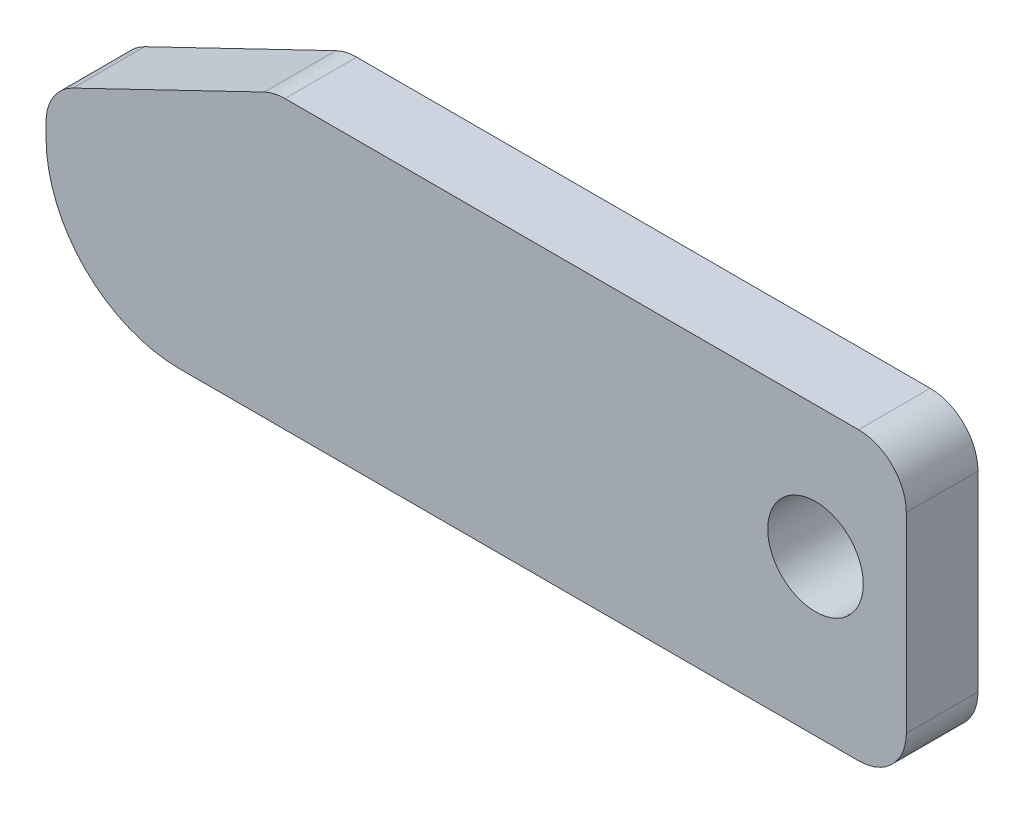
ISO-10303-21;
HEADER;
FILE_DESCRIPTION(('STEP AP214'),'2;1');
FILE_NAME('part.step','',(''),(''),'','','');
FILE_SCHEMA(('AUTOMOTIVE_DESIGN { 1 0 10303 214 1 1 1 1 }'));
ENDSEC;
DATA;
#1=APPLICATION_CONTEXT('core data for automotive mechanical design processes');
#2=APPLICATION_PROTOCOL_DEFINITION('international standard','automotive_design',2000,#1);
#3=PRODUCT_CONTEXT('',#1,'mechanical');
#4=PRODUCT('Part','Part','',(#3));
#5=PRODUCT_RELATED_PRODUCT_CATEGORY('part','',(#4));
#6=PRODUCT_DEFINITION_FORMATION('','',#4);
#7=PRODUCT_DEFINITION_CONTEXT('part definition',#1,'design');
#8=PRODUCT_DEFINITION('design','',#6,#7);
#9=PRODUCT_DEFINITION_SHAPE('','',#8);
#10=(LENGTH_UNIT() NAMED_UNIT(*) SI_UNIT(.MILLI.,.METRE.));
#11=(NAMED_UNIT(*) PLANE_ANGLE_UNIT() SI_UNIT($,.RADIAN.));
#12=(NAMED_UNIT(*) SI_UNIT($,.STERADIAN.) SOLID_ANGLE_UNIT());
#13=UNCERTAINTY_MEASURE_WITH_UNIT(LENGTH_MEASURE(1.E-05),#10,'distance_accuracy_value','');
#14=(GEOMETRIC_REPRESENTATION_CONTEXT(3) GLOBAL_UNCERTAINTY_ASSIGNED_CONTEXT((#13)) GLOBAL_UNIT_ASSIGNED_CONTEXT((#10,
#11,#12)) REPRESENTATION_CONTEXT('',''));
#15=CARTESIAN_POINT('',(0.,0.,0.));
#16=DIRECTION('',(0.,0.,1.));
#17=DIRECTION('',(1.,0.,0.));
#18=AXIS2_PLACEMENT_3D('',#15,#16,#17);
#19=CARTESIAN_POINT('',(-152.,28.,15.));
#20=DIRECTION('',(0.,0.,-1.));
#21=DIRECTION('',(-1.,0.,0.));
#22=AXIS2_PLACEMENT_3D('',#19,#20,#21);
#23=PLANE('',#22);
#24=CARTESIAN_POINT('',(-152.,28.,15.));
#25=DIRECTION('',(0.,0.,1.));
#26=DIRECTION('',(-1.,0.,0.));
#27=AXIS2_PLACEMENT_3D('',#24,#25,#26);
#28=CIRCLE('',#27,28.);
#29=CARTESIAN_POINT('',(-180.,28.,15.));
#30=VERTEX_POINT('',#29);
#31=CARTESIAN_POINT('',(-152.,0.,15.));
#32=VERTEX_POINT('',#31);
#33=EDGE_CURVE('E149',#30,#32,#28,.T.);
#34=ORIENTED_EDGE('',*,*,#33,.T.);
#35=DIRECTION('',(1.,0.,0.));
#36=VECTOR('',#35,1.);
#37=CARTESIAN_POINT('',(-152.,0.,15.));
#38=LINE('',#37,#36);
#39=CARTESIAN_POINT('',(-10.0000000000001,0.,15.));
#40=VERTEX_POINT('',#39);
#41=EDGE_CURVE('E122',#32,#40,#38,.T.);
#42=ORIENTED_EDGE('',*,*,#41,.T.);
#43=CARTESIAN_POINT('',(-10.,10.,15.));
#44=DIRECTION('',(0.,0.,1.));
#45=DIRECTION('',(1.,0.,0.));
#46=AXIS2_PLACEMENT_3D('',#43,#44,#45);
#47=CIRCLE('',#46,10.);
#48=CARTESIAN_POINT('',(0.,10.0000000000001,15.));
#49=VERTEX_POINT('',#48);
#50=EDGE_CURVE('E152',#40,#49,#47,.T.);
#51=ORIENTED_EDGE('',*,*,#50,.T.);
#52=DIRECTION('',(0.,1.,0.));
#53=VECTOR('',#52,1.);
#54=CARTESIAN_POINT('',(0.,49.9999999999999,15.));
#55=LINE('',#54,#53);
#56=CARTESIAN_POINT('',(0.,49.9999999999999,15.));
#57=VERTEX_POINT('',#56);
#58=EDGE_CURVE('E154',#49,#57,#55,.T.);
#59=ORIENTED_EDGE('',*,*,#58,.T.);
#60=CARTESIAN_POINT('',(-10.,50.,15.));
#61=DIRECTION('',(0.,0.,1.));
#62=DIRECTION('',(1.,0.,0.));
#63=AXIS2_PLACEMENT_3D('',#60,#61,#62);
#64=CIRCLE('',#63,10.);
#65=CARTESIAN_POINT('',(-10.0000000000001,60.,15.));
#66=VERTEX_POINT('',#65);
#67=EDGE_CURVE('E156',#57,#66,#64,.T.);
#68=ORIENTED_EDGE('',*,*,#67,.T.);
#69=DIRECTION('',(-1.,0.,0.));
#70=VECTOR('',#69,1.);
#71=CARTESIAN_POINT('',(-130.,60.,15.));
#72=LINE('',#71,#70);
#73=CARTESIAN_POINT('',(-130.,60.,15.));
#74=VERTEX_POINT('',#73);
#75=EDGE_CURVE('E158',#66,#74,#72,.T.);
#76=ORIENTED_EDGE('',*,*,#75,.T.);
#77=CARTESIAN_POINT('',(-130.,50.,15.));
#78=DIRECTION('',(0.,0.,1.));
#79=DIRECTION('',(1.,0.,0.));
#80=AXIS2_PLACEMENT_3D('',#77,#78,#79);
#81=CIRCLE('',#80,10.);
#82=CARTESIAN_POINT('',(-134.342109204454,59.0081123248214,15.));
#83=VERTEX_POINT('',#82);
#84=EDGE_CURVE('E160',#74,#83,#81,.T.);
#85=ORIENTED_EDGE('',*,*,#84,.T.);
#86=DIRECTION('',(-0.900811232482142,-0.434210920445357,0.));
#87=VECTOR('',#86,1.);
#88=CARTESIAN_POINT('',(-134.342109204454,59.0081123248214,15.));
#89=LINE('',#88,#87);
#90=CARTESIAN_POINT('',(-174.342109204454,39.727228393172,15.));
#91=VERTEX_POINT('',#90);
#92=EDGE_CURVE('E162',#83,#91,#89,.T.);
#93=ORIENTED_EDGE('',*,*,#92,.T.);
#94=CARTESIAN_POINT('',(-170.,30.7191160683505,15.));
#95=DIRECTION('',(0.,0.,1.));
#96=DIRECTION('',(1.,0.,0.));
#97=AXIS2_PLACEMENT_3D('',#94,#95,#96);
#98=CIRCLE('',#97,10.);
#99=CARTESIAN_POINT('',(-180.,30.7191160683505,15.));
#100=VERTEX_POINT('',#99);
#101=EDGE_CURVE('E51',#91,#100,#98,.T.);
#102=ORIENTED_EDGE('',*,*,#101,.T.);
#103=DIRECTION('',(0.,-1.,0.));
#104=VECTOR('',#103,1.);
#105=CARTESIAN_POINT('',(-180.,30.7191160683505,15.));
#106=LINE('',#105,#104);
#107=EDGE_CURVE('E46',#100,#30,#106,.T.);
#108=ORIENTED_EDGE('',*,*,#107,.T.);
#109=EDGE_LOOP('',(#34,#42,#51,#59,#68,#76,#85,#93,#102,#108));
#110=FACE_BOUND('',#109,.T.);
#111=CARTESIAN_POINT('',(-19.,32.5,15.));
#112=DIRECTION('',(0.,0.,1.));
#113=DIRECTION('',(1.,0.,0.));
#114=AXIS2_PLACEMENT_3D('',#111,#112,#113);
#115=CIRCLE('',#114,10.);
#116=CARTESIAN_POINT('',(-8.99999999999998,32.5,15.));
#117=VERTEX_POINT('',#116);
#118=EDGE_CURVE('E127',#117,#117,#115,.T.);
#119=ORIENTED_EDGE('',*,*,#118,.F.);
#120=EDGE_LOOP('',(#119));
#121=FACE_BOUND('',#120,.T.);
#122=ADVANCED_FACE('F31',(#110,#121),#23,.F.);
#123=CARTESIAN_POINT('',(-152.,28.,0.));
#124=DIRECTION('',(0.,0.,-1.));
#125=DIRECTION('',(-1.,0.,0.));
#126=AXIS2_PLACEMENT_3D('',#123,#124,#125);
#127=PLANE('',#126);
#128=CARTESIAN_POINT('',(-152.,28.,0.));
#129=DIRECTION('',(0.,0.,1.));
#130=DIRECTION('',(-1.,0.,0.));
#131=AXIS2_PLACEMENT_3D('',#128,#129,#130);
#132=CIRCLE('',#131,28.);
#133=CARTESIAN_POINT('',(-180.,28.,0.));
#134=VERTEX_POINT('',#133);
#135=CARTESIAN_POINT('',(-152.,0.,0.));
#136=VERTEX_POINT('',#135);
#137=EDGE_CURVE('E113',#134,#136,#132,.T.);
#138=ORIENTED_EDGE('',*,*,#137,.F.);
#139=DIRECTION('',(0.,-1.,0.));
#140=VECTOR('',#139,1.);
#141=CARTESIAN_POINT('',(-180.,30.7191160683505,0.));
#142=LINE('',#141,#140);
#143=CARTESIAN_POINT('',(-180.,30.7191160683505,0.));
#144=VERTEX_POINT('',#143);
#145=EDGE_CURVE('E147',#144,#134,#142,.T.);
#146=ORIENTED_EDGE('',*,*,#145,.F.);
#147=CARTESIAN_POINT('',(-170.,30.7191160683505,0.));
#148=DIRECTION('',(0.,0.,1.));
#149=DIRECTION('',(1.,0.,0.));
#150=AXIS2_PLACEMENT_3D('',#147,#148,#149);
#151=CIRCLE('',#150,10.);
#152=CARTESIAN_POINT('',(-174.342109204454,39.727228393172,0.));
#153=VERTEX_POINT('',#152);
#154=EDGE_CURVE('E145',#153,#144,#151,.T.);
#155=ORIENTED_EDGE('',*,*,#154,.F.);
#156=DIRECTION('',(-0.900811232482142,-0.434210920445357,0.));
#157=VECTOR('',#156,1.);
#158=CARTESIAN_POINT('',(-134.342109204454,59.0081123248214,0.));
#159=LINE('',#158,#157);
#160=CARTESIAN_POINT('',(-134.342109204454,59.0081123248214,0.));
#161=VERTEX_POINT('',#160);
#162=EDGE_CURVE('E143',#161,#153,#159,.T.);
#163=ORIENTED_EDGE('',*,*,#162,.F.);
#164=CARTESIAN_POINT('',(-130.,50.,0.));
#165=DIRECTION('',(0.,0.,1.));
#166=DIRECTION('',(1.,0.,0.));
#167=AXIS2_PLACEMENT_3D('',#164,#165,#166);
#168=CIRCLE('',#167,10.);
#169=CARTESIAN_POINT('',(-130.,60.,0.));
#170=VERTEX_POINT('',#169);
#171=EDGE_CURVE('E141',#170,#161,#168,.T.);
#172=ORIENTED_EDGE('',*,*,#171,.F.);
#173=DIRECTION('',(-1.,0.,0.));
#174=VECTOR('',#173,1.);
#175=CARTESIAN_POINT('',(-130.,60.,0.));
#176=LINE('',#175,#174);
#177=CARTESIAN_POINT('',(-10.0000000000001,60.,0.));
#178=VERTEX_POINT('',#177);
#179=EDGE_CURVE('E139',#178,#170,#176,.T.);
#180=ORIENTED_EDGE('',*,*,#179,.F.);
#181=CARTESIAN_POINT('',(-10.,50.,0.));
#182=DIRECTION('',(0.,0.,1.));
#183=DIRECTION('',(1.,0.,0.));
#184=AXIS2_PLACEMENT_3D('',#181,#182,#183);
#185=CIRCLE('',#184,10.);
#186=CARTESIAN_POINT('',(0.,49.9999999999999,0.));
#187=VERTEX_POINT('',#186);
#188=EDGE_CURVE('E137',#187,#178,#185,.T.);
#189=ORIENTED_EDGE('',*,*,#188,.F.);
#190=DIRECTION('',(0.,1.,0.));
#191=VECTOR('',#190,1.);
#192=CARTESIAN_POINT('',(0.,49.9999999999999,0.));
#193=LINE('',#192,#191);
#194=CARTESIAN_POINT('',(0.,10.0000000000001,0.));
#195=VERTEX_POINT('',#194);
#196=EDGE_CURVE('E135',#195,#187,#193,.T.);
#197=ORIENTED_EDGE('',*,*,#196,.F.);
#198=CARTESIAN_POINT('',(-10.,10.,0.));
#199=DIRECTION('',(0.,0.,1.));
#200=DIRECTION('',(1.,0.,0.));
#201=AXIS2_PLACEMENT_3D('',#198,#199,#200);
#202=CIRCLE('',#201,10.);
#203=CARTESIAN_POINT('',(-10.0000000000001,0.,0.));
#204=VERTEX_POINT('',#203);
#205=EDGE_CURVE('E115',#204,#195,#202,.T.);
#206=ORIENTED_EDGE('',*,*,#205,.F.);
#207=DIRECTION('',(1.,0.,0.));
#208=VECTOR('',#207,1.);
#209=CARTESIAN_POINT('',(-152.,0.,0.));
#210=LINE('',#209,#208);
#211=EDGE_CURVE('E108',#136,#204,#210,.T.);
#212=ORIENTED_EDGE('',*,*,#211,.F.);
#213=EDGE_LOOP('',(#138,#146,#155,#163,#172,#180,#189,#197,#206,#212));
#214=FACE_BOUND('',#213,.T.);
#215=CARTESIAN_POINT('',(-19.,32.5,0.));
#216=DIRECTION('',(0.,0.,1.));
#217=DIRECTION('',(1.,0.,0.));
#218=AXIS2_PLACEMENT_3D('',#215,#216,#217);
#219=CIRCLE('',#218,10.);
#220=CARTESIAN_POINT('',(-8.99999999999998,32.5,0.));
#221=VERTEX_POINT('',#220);
#222=EDGE_CURVE('E130',#221,#221,#219,.T.);
#223=ORIENTED_EDGE('',*,*,#222,.T.);
#224=EDGE_LOOP('',(#223));
#225=FACE_BOUND('',#224,.T.);
#226=ADVANCED_FACE('F109',(#214,#225),#127,.T.);
#227=CARTESIAN_POINT('',(-152.,28.,15.));
#228=DIRECTION('',(0.,0.,-1.));
#229=DIRECTION('',(-1.,0.,0.));
#230=AXIS2_PLACEMENT_3D('',#227,#228,#229);
#231=CYLINDRICAL_SURFACE('',#230,28.);
#232=ORIENTED_EDGE('',*,*,#137,.T.);
#233=DIRECTION('',(0.,0.,-1.));
#234=VECTOR('',#233,1.);
#235=CARTESIAN_POINT('',(-152.,0.,15.));
#236=LINE('',#235,#234);
#237=EDGE_CURVE('E11',#32,#136,#236,.T.);
#238=ORIENTED_EDGE('',*,*,#237,.F.);
#239=ORIENTED_EDGE('',*,*,#33,.F.);
#240=DIRECTION('',(0.,0.,-1.));
#241=VECTOR('',#240,1.);
#242=CARTESIAN_POINT('',(-180.,28.,15.));
#243=LINE('',#242,#241);
#244=EDGE_CURVE('E126',#30,#134,#243,.T.);
#245=ORIENTED_EDGE('',*,*,#244,.T.);
#246=EDGE_LOOP('',(#232,#238,#239,#245));
#247=FACE_BOUND('',#246,.T.);
#248=ADVANCED_FACE('F33',(#247),#231,.T.);
#249=CARTESIAN_POINT('',(-152.,0.,15.));
#250=DIRECTION('',(0.,1.,0.));
#251=DIRECTION('',(0.,0.,1.));
#252=AXIS2_PLACEMENT_3D('',#249,#250,#251);
#253=PLANE('',#252);
#254=ORIENTED_EDGE('',*,*,#211,.T.);
#255=DIRECTION('',(0.,0.,-1.));
#256=VECTOR('',#255,1.);
#257=CARTESIAN_POINT('',(-10.0000000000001,0.,15.));
#258=LINE('',#257,#256);
#259=EDGE_CURVE('E39',#40,#204,#258,.T.);
#260=ORIENTED_EDGE('',*,*,#259,.F.);
#261=ORIENTED_EDGE('',*,*,#41,.F.);
#262=ORIENTED_EDGE('',*,*,#237,.T.);
#263=EDGE_LOOP('',(#254,#260,#261,#262));
#264=FACE_BOUND('',#263,.T.);
#265=ADVANCED_FACE('F121',(#264),#253,.F.);
#266=CARTESIAN_POINT('',(-10.,10.,15.));
#267=DIRECTION('',(0.,0.,-1.));
#268=DIRECTION('',(-1.,0.,0.));
#269=AXIS2_PLACEMENT_3D('',#266,#267,#268);
#270=CYLINDRICAL_SURFACE('',#269,10.);
#271=ORIENTED_EDGE('',*,*,#205,.T.);
#272=DIRECTION('',(0.,0.,-1.));
#273=VECTOR('',#272,1.);
#274=CARTESIAN_POINT('',(0.,10.0000000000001,15.));
#275=LINE('',#274,#273);
#276=EDGE_CURVE('E185',#49,#195,#275,.T.);
#277=ORIENTED_EDGE('',*,*,#276,.F.);
#278=ORIENTED_EDGE('',*,*,#50,.F.);
#279=ORIENTED_EDGE('',*,*,#259,.T.);
#280=EDGE_LOOP('',(#271,#277,#278,#279));
#281=FACE_BOUND('',#280,.T.);
#282=ADVANCED_FACE('F189',(#281),#270,.T.);
#283=CARTESIAN_POINT('',(0.,49.9999999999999,15.));
#284=DIRECTION('',(-1.,0.,0.));
#285=DIRECTION('',(0.,-1.,0.));
#286=AXIS2_PLACEMENT_3D('',#283,#284,#285);
#287=PLANE('',#286);
#288=ORIENTED_EDGE('',*,*,#196,.T.);
#289=DIRECTION('',(0.,0.,-1.));
#290=VECTOR('',#289,1.);
#291=CARTESIAN_POINT('',(0.,49.9999999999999,15.));
#292=LINE('',#291,#290);
#293=EDGE_CURVE('E182',#57,#187,#292,.T.);
#294=ORIENTED_EDGE('',*,*,#293,.F.);
#295=ORIENTED_EDGE('',*,*,#58,.F.);
#296=ORIENTED_EDGE('',*,*,#276,.T.);
#297=EDGE_LOOP('',(#288,#294,#295,#296));
#298=FACE_BOUND('',#297,.T.);
#299=ADVANCED_FACE('F197',(#298),#287,.F.);
#300=CARTESIAN_POINT('',(-10.,50.,15.));
#301=DIRECTION('',(0.,0.,-1.));
#302=DIRECTION('',(-1.,0.,0.));
#303=AXIS2_PLACEMENT_3D('',#300,#301,#302);
#304=CYLINDRICAL_SURFACE('',#303,10.);
#305=ORIENTED_EDGE('',*,*,#188,.T.);
#306=DIRECTION('',(0.,0.,-1.));
#307=VECTOR('',#306,1.);
#308=CARTESIAN_POINT('',(-10.0000000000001,60.,15.));
#309=LINE('',#308,#307);
#310=EDGE_CURVE('E179',#66,#178,#309,.T.);
#311=ORIENTED_EDGE('',*,*,#310,.F.);
#312=ORIENTED_EDGE('',*,*,#67,.F.);
#313=ORIENTED_EDGE('',*,*,#293,.T.);
#314=EDGE_LOOP('',(#305,#311,#312,#313));
#315=FACE_BOUND('',#314,.T.);
#316=ADVANCED_FACE('F200',(#315),#304,.T.);
#317=CARTESIAN_POINT('',(-130.,60.,15.));
#318=DIRECTION('',(0.,-1.,0.));
#319=DIRECTION('',(0.,0.,-1.));
#320=AXIS2_PLACEMENT_3D('',#317,#318,#319);
#321=PLANE('',#320);
#322=ORIENTED_EDGE('',*,*,#179,.T.);
#323=DIRECTION('',(0.,0.,-1.));
#324=VECTOR('',#323,1.);
#325=CARTESIAN_POINT('',(-130.,60.,15.));
#326=LINE('',#325,#324);
#327=EDGE_CURVE('E176',#74,#170,#326,.T.);
#328=ORIENTED_EDGE('',*,*,#327,.F.);
#329=ORIENTED_EDGE('',*,*,#75,.F.);
#330=ORIENTED_EDGE('',*,*,#310,.T.);
#331=EDGE_LOOP('',(#322,#328,#329,#330));
#332=FACE_BOUND('',#331,.T.);
#333=ADVANCED_FACE('F205',(#332),#321,.F.);
#334=CARTESIAN_POINT('',(-130.,50.,15.));
#335=DIRECTION('',(0.,0.,-1.));
#336=DIRECTION('',(-1.,0.,0.));
#337=AXIS2_PLACEMENT_3D('',#334,#335,#336);
#338=CYLINDRICAL_SURFACE('',#337,10.);
#339=ORIENTED_EDGE('',*,*,#171,.T.);
#340=DIRECTION('',(0.,0.,-1.));
#341=VECTOR('',#340,1.);
#342=CARTESIAN_POINT('',(-134.342109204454,59.0081123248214,15.));
#343=LINE('',#342,#341);
#344=EDGE_CURVE('E173',#83,#161,#343,.T.);
#345=ORIENTED_EDGE('',*,*,#344,.F.);
#346=ORIENTED_EDGE('',*,*,#84,.F.);
#347=ORIENTED_EDGE('',*,*,#327,.T.);
#348=EDGE_LOOP('',(#339,#345,#346,#347));
#349=FACE_BOUND('',#348,.T.);
#350=ADVANCED_FACE('F211',(#349),#338,.T.);
#351=CARTESIAN_POINT('',(-134.342109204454,59.0081123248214,15.));
#352=DIRECTION('',(0.434210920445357,-0.900811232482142,0.));
#353=DIRECTION('',(0.900811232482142,0.434210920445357,0.));
#354=AXIS2_PLACEMENT_3D('',#351,#352,#353);
#355=PLANE('',#354);
#356=ORIENTED_EDGE('',*,*,#162,.T.);
#357=DIRECTION('',(0.,0.,-1.));
#358=VECTOR('',#357,1.);
#359=CARTESIAN_POINT('',(-174.342109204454,39.727228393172,15.));
#360=LINE('',#359,#358);
#361=EDGE_CURVE('E170',#91,#153,#360,.T.);
#362=ORIENTED_EDGE('',*,*,#361,.F.);
#363=ORIENTED_EDGE('',*,*,#92,.F.);
#364=ORIENTED_EDGE('',*,*,#344,.T.);
#365=EDGE_LOOP('',(#356,#362,#363,#364));
#366=FACE_BOUND('',#365,.T.);
#367=ADVANCED_FACE('F215',(#366),#355,.F.);
#368=CARTESIAN_POINT('',(-170.,30.7191160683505,15.));
#369=DIRECTION('',(0.,0.,-1.));
#370=DIRECTION('',(-1.,0.,0.));
#371=AXIS2_PLACEMENT_3D('',#368,#369,#370);
#372=CYLINDRICAL_SURFACE('',#371,10.);
#373=ORIENTED_EDGE('',*,*,#154,.T.);
#374=DIRECTION('',(0.,0.,-1.));
#375=VECTOR('',#374,1.);
#376=CARTESIAN_POINT('',(-180.,30.7191160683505,15.));
#377=LINE('',#376,#375);
#378=EDGE_CURVE('E167',#100,#144,#377,.T.);
#379=ORIENTED_EDGE('',*,*,#378,.F.);
#380=ORIENTED_EDGE('',*,*,#101,.F.);
#381=ORIENTED_EDGE('',*,*,#361,.T.);
#382=EDGE_LOOP('',(#373,#379,#380,#381));
#383=FACE_BOUND('',#382,.T.);
#384=ADVANCED_FACE('F218',(#383),#372,.T.);
#385=CARTESIAN_POINT('',(-180.,30.7191160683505,15.));
#386=DIRECTION('',(1.,0.,0.));
#387=DIRECTION('',(0.,1.,0.));
#388=AXIS2_PLACEMENT_3D('',#385,#386,#387);
#389=PLANE('',#388);
#390=ORIENTED_EDGE('',*,*,#145,.T.);
#391=ORIENTED_EDGE('',*,*,#244,.F.);
#392=ORIENTED_EDGE('',*,*,#107,.F.);
#393=ORIENTED_EDGE('',*,*,#378,.T.);
#394=EDGE_LOOP('',(#390,#391,#392,#393));
#395=FACE_BOUND('',#394,.T.);
#396=ADVANCED_FACE('F220',(#395),#389,.F.);
#397=CARTESIAN_POINT('',(-19.,32.5,15.));
#398=DIRECTION('',(0.,0.,-1.));
#399=DIRECTION('',(-1.,0.,0.));
#400=AXIS2_PLACEMENT_3D('',#397,#398,#399);
#401=CYLINDRICAL_SURFACE('',#400,10.);
#402=ORIENTED_EDGE('',*,*,#118,.T.);
#403=EDGE_LOOP('',(#402));
#404=FACE_BOUND('',#403,.T.);
#405=ORIENTED_EDGE('',*,*,#222,.F.);
#406=EDGE_LOOP('',(#405));
#407=FACE_BOUND('',#406,.T.);
#408=ADVANCED_FACE('F222',(#404,#407),#401,.F.);
#409=CLOSED_SHELL('',(#122,#226,#248,#265,#282,#299,#316,#333,#350,#367,#384,#396,#408));
#410=MANIFOLD_SOLID_BREP('B2',#409);
#411=ADVANCED_BREP_SHAPE_REPRESENTATION('',(#18,#410),#14);
#412=SHAPE_DEFINITION_REPRESENTATION(#9,#411);
ENDSEC;
END-ISO-10303-21;
